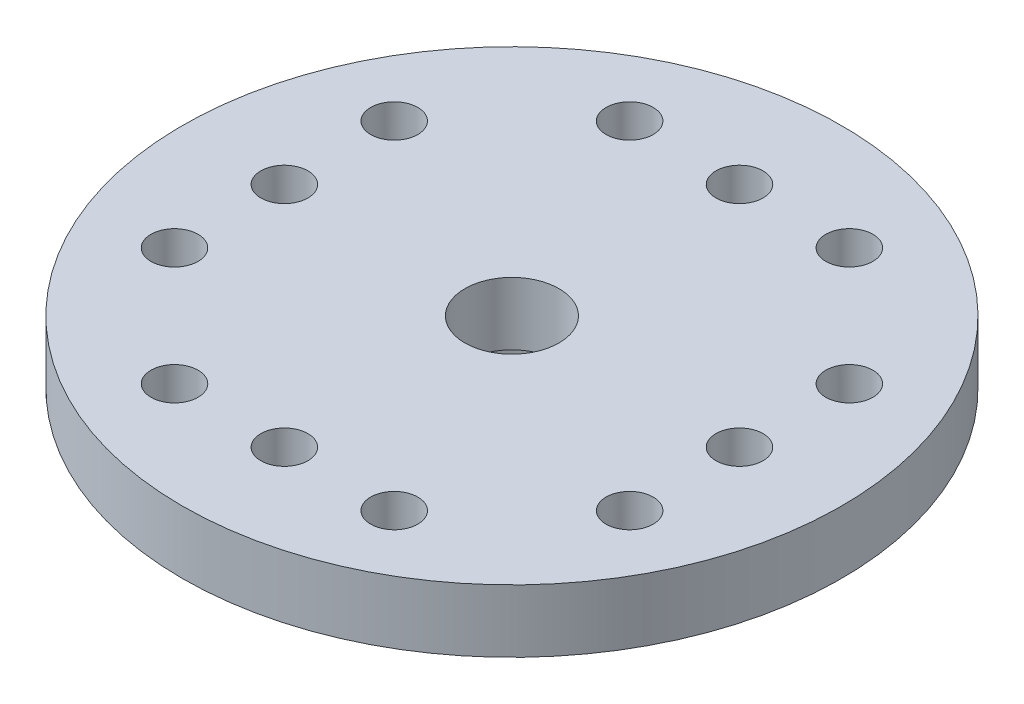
from build123d import *

# Parameters (mm, degrees)
SKETCH1_R           = 10.5
SKETCH1_R_2         = 1.5
BOSS_EXTRUDE1_DEPTH = 2
SKETCH2_R           = 4.4
SKETCH2_R_2         = 3
BOSS_EXTRUDE2_DEPTH = 3.7
SKETCH3_R           = 0.75
CUT_EXTRUDE1_DEPTH  = 10


with BuildPart() as part:
    # Sketch1 → Boss-Extrude1 (new body)
    with BuildSketch(Plane(origin=(0, 0, 0), x_dir=(1, 0, 0), z_dir=(0, 1, 0))):
        with Locations(Location((0, 0, 0), (0, 0, 270))):
            Circle(SKETCH1_R)
        with Locations(Location((0, 0, 0), (0, 0, 270))):
            Circle(SKETCH1_R_2, mode=Mode.SUBTRACT)
    extrude(amount=-BOSS_EXTRUDE1_DEPTH)

    # Sketch2 → Boss-Extrude2 (add)
    with BuildSketch(Plane.XZ.offset(2)):
        with Locations(Location((0, 0, 0), (0, 0, 90))):
            Circle(SKETCH2_R)
        with Locations(Location((0, 0, 0), (0, 0, 270))):
            Circle(SKETCH2_R_2, mode=Mode.SUBTRACT)
    extrude(amount=BOSS_EXTRUDE2_DEPTH)

    # Sketch3 → Cut-Extrude1 (cut)
    with BuildSketch(Plane(origin=(0, 0, 0), x_dir=(1, 0, 0), z_dir=(0, 1, 0))):
        with Locations(Location((0, 7.25, 0), (0, 0, 270))):
            Circle(SKETCH3_R)
        with Locations(Location((3.5, 7.25, 0), (0, 0, 270))):
            Circle(SKETCH3_R)
        with Locations(Location((-3.5, 7.25, 0), (0, 0, 270))):
            Circle(SKETCH3_R)
        with Locations(Location((-7.25, 3.5, 0), (0, 0, 270))):
            Circle(SKETCH3_R)
        with Locations(Location((-7.25, -3.5, 0), (0, 0, 270))):
            Circle(SKETCH3_R)
        with Locations(Location((-7.25, 0, 0), (0, 0, 270))):
            Circle(SKETCH3_R)
        with Locations(Location((7.25, -3.5, 0), (0, 0, 270))):
            Circle(SKETCH3_R)
        with Locations(Location((7.25, 3.5, 0), (0, 0, 270))):
            Circle(SKETCH3_R)
        with Locations(Location((7.25, 0, 0), (0, 0, 270))):
            Circle(SKETCH3_R)
        with Locations(Location((0, -7.25, 0), (0, 0, 270))):
            Circle(SKETCH3_R)
        with Locations(Location((-3.5, -7.25, 0), (0, 0, 270))):
            Circle(SKETCH3_R)
        with Locations(Location((3.5, -7.25, 0), (0, 0, 270))):
            Circle(SKETCH3_R)
    extrude(amount=-CUT_EXTRUDE1_DEPTH, mode=Mode.SUBTRACT)


solid = part.part
